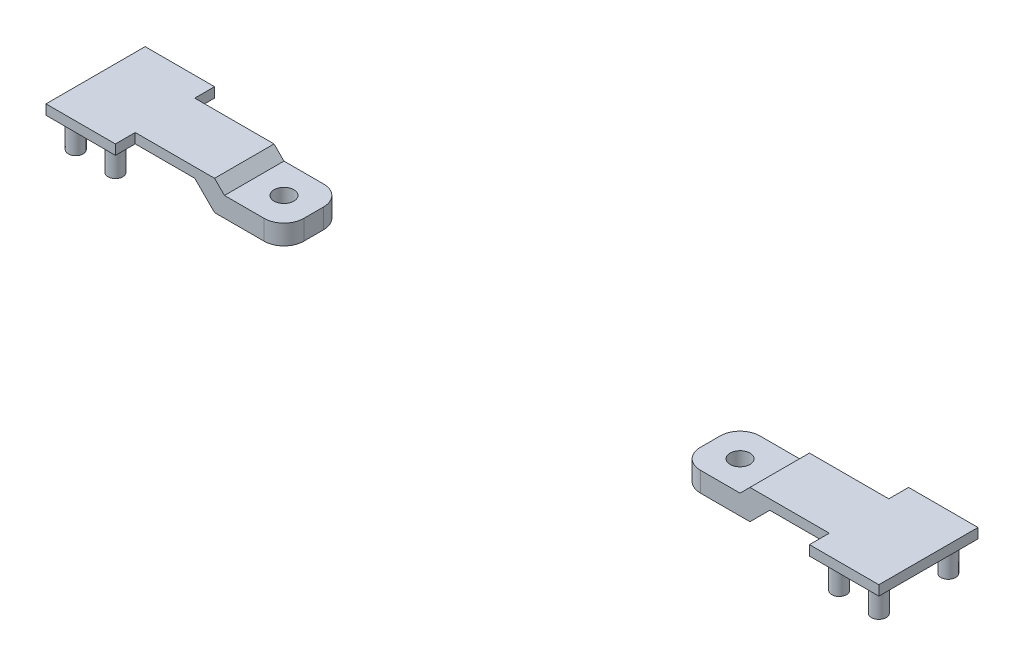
from build123d import *

# Parameters (mm, degrees)
SKETCH1_W             = 70
SKETCH1_H             = 100
BOSS_EXTRUDE1_DEPTH   = 10
BOSS_EXTRUDE1_2_DEPTH = 10
BOSS_EXTRUDE2_DEPTH   = 30
BOSS_EXTRUDE3_DEPTH   = 30
SKETCH3_R             = 10
CUT_EXTRUDE1_DEPTH    = 44
FILLET1_R             = 20
FILLET2_R             = 20


with BuildPart() as part:
    # Sketch1 → Boss-Extrude1 (new body)
    with BuildSketch(Plane(origin=(0, 0, 0), x_dir=(1, 0, 0), z_dir=(0, 1, 0))):
        with Locations((-385, 0)):
            Rectangle(SKETCH1_W, SKETCH1_H)
    extrude(amount=BOSS_EXTRUDE1_DEPTH)



with BuildPart() as body_2:
    # Sketch1 → Boss-Extrude1 2 (new body)
    with BuildSketch(Plane(origin=(0, 0, 0), x_dir=(1, 0, 0), z_dir=(0, 1, 0))):
        with Locations((385, 0)):
            Rectangle(SKETCH1_W, SKETCH1_H)
    extrude(amount=BOSS_EXTRUDE1_2_DEPTH)


with BuildPart() as part_1:
    add(part.part)

    add(body_2.part)  # Boss-Extrude2 merges body 2
    # Sketch1_3 → Boss-Extrude2 (add)
    with BuildSketch(Plane(origin=(0, 0, 0), x_dir=(1, 0, 0), z_dir=(0, 1, 0))):
        with BuildLine():
            ThreePointArc((-405, -27.5), (-410.303300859, -40.303300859), (-397.5, -35))
            Line((-397.5, -35), (-405, -35))
            Line((-405, -35), (-405, -27.5))
        make_face()
        with BuildLine():
            Line((-405, -35), (-397.5, -35))
            ThreePointArc((-397.5, -35), (-399.696699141, -29.696699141), (-405, -27.5))
            Line((-405, -27.5), (-405, -35))
        make_face()
        with BuildLine():
            ThreePointArc((-405, -27.5), (-410.303300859, -40.303300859), (-397.5, -35))
            Line((-397.5, -35), (-405, -35))
            Line((-405, -35), (-405, -27.5))
        make_face()
        with BuildLine():
            Line((-405, -35), (-397.5, -35))
            ThreePointArc((-397.5, -35), (-399.696699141, -29.696699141), (-405, -27.5))
            Line((-405, -27.5), (-405, -35))
        make_face()
        with BuildLine():
            ThreePointArc((-357.5, -35), (-359.696699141, -29.696699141), (-365, -27.5))
            Line((-365, -27.5), (-365, -35))
            Line((-365, -35), (-372.5, -35))
            ThreePointArc((-372.5, -35), (-365, -42.5), (-357.5, -35))
        make_face()
        with BuildLine():
            Line((-365, -35), (-365, -27.5))
            ThreePointArc((-365, -27.5), (-370.303300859, -29.696699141), (-372.5, -35))
            Line((-372.5, -35), (-365, -35))
        make_face()
        with BuildLine():
            ThreePointArc((-357.5, -35), (-359.696699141, -29.696699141), (-365, -27.5))
            Line((-365, -27.5), (-365, -35))
            Line((-365, -35), (-372.5, -35))
            ThreePointArc((-372.5, -35), (-365, -42.5), (-357.5, -35))
        make_face()
        with BuildLine():
            Line((-365, -35), (-365, -27.5))
            ThreePointArc((-365, -27.5), (-370.303300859, -29.696699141), (-372.5, -35))
            Line((-372.5, -35), (-365, -35))
        make_face()
        with BuildLine():
            ThreePointArc((-372.5, 35), (-370.303300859, 29.696699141), (-365, 27.5))
            Line((-365, 27.5), (-365, 35))
            Line((-365, 35), (-372.5, 35))
        make_face()
        with BuildLine():
            Line((-365, 35), (-365, 27.5))
            ThreePointArc((-365, 27.5), (-359.696699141, 29.696699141), (-357.5, 35))
            ThreePointArc((-357.5, 35), (-365, 42.5), (-372.5, 35))
            Line((-372.5, 35), (-365, 35))
        make_face()
        with BuildLine():
            ThreePointArc((-372.5, 35), (-370.303300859, 29.696699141), (-365, 27.5))
            Line((-365, 27.5), (-365, 35))
            Line((-365, 35), (-372.5, 35))
        make_face()
        with BuildLine():
            Line((-365, 35), (-365, 27.5))
            ThreePointArc((-365, 27.5), (-359.696699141, 29.696699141), (-357.5, 35))
            ThreePointArc((-357.5, 35), (-365, 42.5), (-372.5, 35))
            Line((-372.5, 35), (-365, 35))
        make_face()
        with BuildLine():
            ThreePointArc((-405, 27.5), (-399.696699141, 29.696699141), (-397.5, 35))
            Line((-397.5, 35), (-405, 35))
            Line((-405, 35), (-405, 27.5))
        make_face()
        with BuildLine():
            Line((-405, 35), (-397.5, 35))
            ThreePointArc((-397.5, 35), (-410.303300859, 40.303300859), (-405, 27.5))
            Line((-405, 27.5), (-405, 35))
        make_face()
        with BuildLine():
            ThreePointArc((-405, 27.5), (-399.696699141, 29.696699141), (-397.5, 35))
            Line((-397.5, 35), (-405, 35))
            Line((-405, 35), (-405, 27.5))
        make_face()
        with BuildLine():
            Line((-405, 35), (-397.5, 35))
            ThreePointArc((-397.5, 35), (-410.303300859, 40.303300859), (-405, 27.5))
            Line((-405, 27.5), (-405, 35))
        make_face()
        with BuildLine():
            ThreePointArc((372.5, -35), (370.303300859, -29.696699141), (365, -27.5))
            Line((365, -27.5), (365, -35))
            Line((365, -35), (372.5, -35))
        make_face()
        with BuildLine():
            Line((365, -35), (365, -27.5))
            ThreePointArc((365, -27.5), (359.696699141, -40.303300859), (372.5, -35))
            Line((372.5, -35), (365, -35))
        make_face()
        with BuildLine():
            ThreePointArc((372.5, -35), (370.303300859, -29.696699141), (365, -27.5))
            Line((365, -27.5), (365, -35))
            Line((365, -35), (372.5, -35))
        make_face()
        with BuildLine():
            Line((365, -35), (365, -27.5))
            ThreePointArc((365, -27.5), (359.696699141, -40.303300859), (372.5, -35))
            Line((372.5, -35), (365, -35))
        make_face()
        with BuildLine():
            ThreePointArc((405, -27.5), (399.696699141, -29.696699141), (397.5, -35))
            Line((397.5, -35), (405, -35))
            Line((405, -35), (405, -27.5))
        make_face()
        with BuildLine():
            Line((405, -35), (397.5, -35))
            ThreePointArc((397.5, -35), (405, -42.5), (412.5, -35))
            ThreePointArc((412.5, -35), (410.303300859, -29.696699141), (405, -27.5))
            Line((405, -27.5), (405, -35))
        make_face()
        with BuildLine():
            ThreePointArc((405, -27.5), (399.696699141, -29.696699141), (397.5, -35))
            Line((397.5, -35), (405, -35))
            Line((405, -35), (405, -27.5))
        make_face()
        with BuildLine():
            Line((405, -35), (397.5, -35))
            ThreePointArc((397.5, -35), (405, -42.5), (412.5, -35))
            ThreePointArc((412.5, -35), (410.303300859, -29.696699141), (405, -27.5))
            Line((405, -27.5), (405, -35))
        make_face()
        with BuildLine():
            ThreePointArc((412.5, 35), (405, 42.5), (397.5, 35))
            Line((397.5, 35), (405, 35))
            Line((405, 35), (405, 27.5))
            ThreePointArc((405, 27.5), (410.303300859, 29.696699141), (412.5, 35))
        make_face()
        with BuildLine():
            Line((405, 35), (397.5, 35))
            ThreePointArc((397.5, 35), (399.696699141, 29.696699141), (405, 27.5))
            Line((405, 27.5), (405, 35))
        make_face()
        with BuildLine():
            ThreePointArc((412.5, 35), (405, 42.5), (397.5, 35))
            Line((397.5, 35), (405, 35))
            Line((405, 35), (405, 27.5))
            ThreePointArc((405, 27.5), (410.303300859, 29.696699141), (412.5, 35))
        make_face()
        with BuildLine():
            Line((405, 35), (397.5, 35))
            ThreePointArc((397.5, 35), (399.696699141, 29.696699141), (405, 27.5))
            Line((405, 27.5), (405, 35))
        make_face()
        with BuildLine():
            ThreePointArc((372.5, 35), (359.696699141, 40.303300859), (365, 27.5))
            Line((365, 27.5), (365, 35))
            Line((365, 35), (372.5, 35))
        make_face()
        with BuildLine():
            Line((365, 35), (365, 27.5))
            ThreePointArc((365, 27.5), (370.303300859, 29.696699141), (372.5, 35))
            Line((372.5, 35), (365, 35))
        make_face()
        with BuildLine():
            ThreePointArc((372.5, 35), (359.696699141, 40.303300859), (365, 27.5))
            Line((365, 27.5), (365, 35))
            Line((365, 35), (372.5, 35))
        make_face()
        with BuildLine():
            Line((365, 35), (365, 27.5))
            ThreePointArc((365, 27.5), (370.303300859, 29.696699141), (372.5, 35))
            Line((372.5, 35), (365, 35))
        make_face()
    extrude(amount=-BOSS_EXTRUDE2_DEPTH)

    # Sketch2 → Boss-Extrude3 (add, symmetric)
    with BuildSketch(Plane.XY):
        Polygon((-350, 10), (-270, 10), (-260, 0), (-200, 0), (-200, -20), (-270, -20), (-290, 0), (-350, 0), align=None)
        Polygon((350, 10), (350, 0), (290, 0), (270, -20), (200, -20), (200, 0), (260, 0), (270, 10), align=None)
    extrude(amount=BOSS_EXTRUDE3_DEPTH, both=True)

    # Sketch3 → Cut-Extrude1 (cut)
    with BuildSketch(Plane(origin=(0, 0, 0), x_dir=(1, 0, 0), z_dir=(0, 1, 0))):
        with Locations(Location((-230, 0, 0), (0, 0, 180))):
            Circle(SKETCH3_R)
        with Locations(Location((230, 0, 0), (0, 0, 180))):
            Circle(SKETCH3_R)
    extrude(amount=-CUT_EXTRUDE1_DEPTH, mode=Mode.SUBTRACT)

    # Fillet1
    fillet1_edges = [part_1.edges().sort_by_distance(p)[0] for p in [
        (-200, -10, 30),
        (-200, -10, -30),
    ]]
    fillet(fillet1_edges, radius=FILLET1_R)

    # Fillet2
    fillet2_edges = [part_1.edges().sort_by_distance(p)[0] for p in [
        (200, -10, -30),
        (200, -10, 30),
    ]]
    fillet(fillet2_edges, radius=FILLET2_R)


solid = part_1.part
